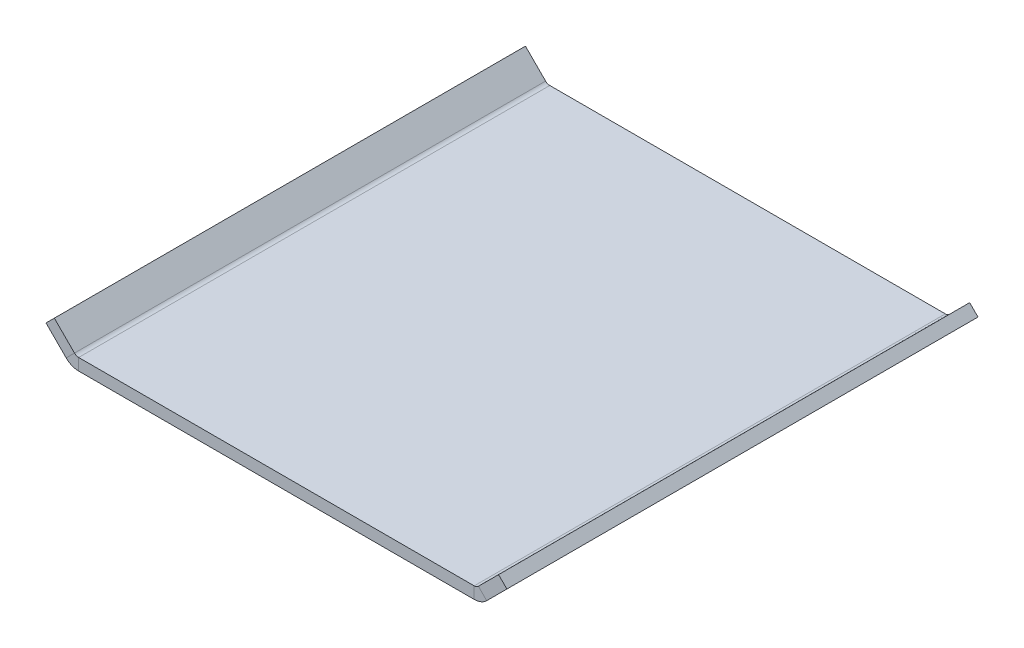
ISO-10303-21;
HEADER;
FILE_DESCRIPTION(('STEP AP214'),'2;1');
FILE_NAME('part.step','',(''),(''),'','','');
FILE_SCHEMA(('AUTOMOTIVE_DESIGN { 1 0 10303 214 1 1 1 1 }'));
ENDSEC;
DATA;
#1=APPLICATION_CONTEXT('core data for automotive mechanical design processes');
#2=APPLICATION_PROTOCOL_DEFINITION('international standard','automotive_design',2000,#1);
#3=PRODUCT_CONTEXT('',#1,'mechanical');
#4=PRODUCT('Part','Part','',(#3));
#5=PRODUCT_RELATED_PRODUCT_CATEGORY('part','',(#4));
#6=PRODUCT_DEFINITION_FORMATION('','',#4);
#7=PRODUCT_DEFINITION_CONTEXT('part definition',#1,'design');
#8=PRODUCT_DEFINITION('design','',#6,#7);
#9=PRODUCT_DEFINITION_SHAPE('','',#8);
#10=(LENGTH_UNIT() NAMED_UNIT(*) SI_UNIT(.MILLI.,.METRE.));
#11=(NAMED_UNIT(*) PLANE_ANGLE_UNIT() SI_UNIT($,.RADIAN.));
#12=(NAMED_UNIT(*) SI_UNIT($,.STERADIAN.) SOLID_ANGLE_UNIT());
#13=UNCERTAINTY_MEASURE_WITH_UNIT(LENGTH_MEASURE(1.E-05),#10,'distance_accuracy_value','');
#14=(GEOMETRIC_REPRESENTATION_CONTEXT(3) GLOBAL_UNCERTAINTY_ASSIGNED_CONTEXT((#13)) GLOBAL_UNIT_ASSIGNED_CONTEXT((#10,
#11,#12)) REPRESENTATION_CONTEXT('',''));
#15=CARTESIAN_POINT('',(0.,0.,0.));
#16=DIRECTION('',(0.,0.,1.));
#17=DIRECTION('',(1.,0.,0.));
#18=AXIS2_PLACEMENT_3D('',#15,#16,#17);
#19=CARTESIAN_POINT('',(0.,-6.35,0.));
#20=DIRECTION('',(0.,1.,0.));
#21=DIRECTION('',(0.,0.,1.));
#22=AXIS2_PLACEMENT_3D('',#19,#20,#21);
#23=PLANE('',#22);
#24=DIRECTION('',(-0.707106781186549,0.,-0.707106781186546));
#25=VECTOR('',#24,1.);
#26=CARTESIAN_POINT('',(-106.120727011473,-6.35,106.120727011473));
#27=LINE('',#26,#25);
#28=CARTESIAN_POINT('',(-94.9856629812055,-6.35,117.25579104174));
#29=VERTEX_POINT('',#28);
#30=CARTESIAN_POINT('',(-99.4757910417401,-6.35,112.765662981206));
#31=VERTEX_POINT('',#30);
#32=EDGE_CURVE('E453',#29,#31,#27,.T.);
#33=ORIENTED_EDGE('',*,*,#32,.F.);
#34=DIRECTION('',(-0.707106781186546,0.,0.707106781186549));
#35=VECTOR('',#34,1.);
#36=CARTESIAN_POINT('',(11.1350640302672,-6.35,11.1350640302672));
#37=LINE('',#36,#35);
#38=CARTESIAN_POINT('',(-48.5098079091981,-6.35,70.7799359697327));
#39=VERTEX_POINT('',#38);
#40=EDGE_CURVE('E399',#39,#29,#37,.T.);
#41=ORIENTED_EDGE('',*,*,#40,.F.);
#42=CARTESIAN_POINT('',(-46.2647438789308,-6.35,73.025));
#43=DIRECTION('',(0.,1.,0.));
#44=DIRECTION('',(0.,0.,1.));
#45=AXIS2_PLACEMENT_3D('',#42,#43,#44);
#46=CIRCLE('',#45,3.175);
#47=CARTESIAN_POINT('',(-46.2647438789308,-6.35,69.85));
#48=VERTEX_POINT('',#47);
#49=EDGE_CURVE('E411',#48,#39,#46,.T.);
#50=ORIENTED_EDGE('',*,*,#49,.F.);
#51=DIRECTION('',(-1.,0.,0.));
#52=VECTOR('',#51,1.);
#53=CARTESIAN_POINT('',(0.,-6.35,69.85));
#54=LINE('',#53,#52);
#55=CARTESIAN_POINT('',(-38.0548719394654,-6.35,69.85));
#56=VERTEX_POINT('',#55);
#57=EDGE_CURVE('E414',#56,#48,#54,.T.);
#58=ORIENTED_EDGE('',*,*,#57,.F.);
#59=DIRECTION('',(0.,0.,-1.));
#60=VECTOR('',#59,1.);
#61=CARTESIAN_POINT('',(-38.0548719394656,-6.35,0.));
#62=LINE('',#61,#60);
#63=CARTESIAN_POINT('',(-38.0548719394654,-6.35,76.2));
#64=VERTEX_POINT('',#63);
#65=EDGE_CURVE('E417',#64,#56,#62,.T.);
#66=ORIENTED_EDGE('',*,*,#65,.F.);
#67=DIRECTION('',(-1.,0.,0.));
#68=VECTOR('',#67,1.);
#69=CARTESIAN_POINT('',(0.,-6.35,76.2));
#70=LINE('',#69,#68);
#71=CARTESIAN_POINT('',(38.1451280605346,-6.35,76.2));
#72=VERTEX_POINT('',#71);
#73=EDGE_CURVE('E420',#72,#64,#70,.T.);
#74=ORIENTED_EDGE('',*,*,#73,.F.);
#75=DIRECTION('',(0.,0.,1.));
#76=VECTOR('',#75,1.);
#77=CARTESIAN_POINT('',(38.1451280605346,-6.35,0.));
#78=LINE('',#77,#76);
#79=CARTESIAN_POINT('',(38.1451280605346,-6.35,69.85));
#80=VERTEX_POINT('',#79);
#81=EDGE_CURVE('E423',#80,#72,#78,.T.);
#82=ORIENTED_EDGE('',*,*,#81,.F.);
#83=DIRECTION('',(-1.,0.,0.));
#84=VECTOR('',#83,1.);
#85=CARTESIAN_POINT('',(0.,-6.35,69.85));
#86=LINE('',#85,#84);
#87=CARTESIAN_POINT('',(46.355,-6.35,69.85));
#88=VERTEX_POINT('',#87);
#89=EDGE_CURVE('E426',#88,#80,#86,.T.);
#90=ORIENTED_EDGE('',*,*,#89,.F.);
#91=CARTESIAN_POINT('',(46.355,-6.35,73.025));
#92=DIRECTION('',(0.,1.,0.));
#93=DIRECTION('',(0.,0.,1.));
#94=AXIS2_PLACEMENT_3D('',#91,#92,#93);
#95=CIRCLE('',#94,3.175);
#96=CARTESIAN_POINT('',(48.6000640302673,-6.35,70.7799359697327));
#97=VERTEX_POINT('',#96);
#98=EDGE_CURVE('E429',#97,#88,#95,.T.);
#99=ORIENTED_EDGE('',*,*,#98,.F.);
#100=DIRECTION('',(-0.707106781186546,0.,-0.707106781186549));
#101=VECTOR('',#100,1.);
#102=CARTESIAN_POINT('',(-11.0899359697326,-6.35,11.0899359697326));
#103=LINE('',#102,#101);
#104=CARTESIAN_POINT('',(95.0759191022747,-6.35,117.25579104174));
#105=VERTEX_POINT('',#104);
#106=EDGE_CURVE('E432',#105,#97,#103,.T.);
#107=ORIENTED_EDGE('',*,*,#106,.F.);
#108=DIRECTION('',(-0.707106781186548,0.,0.707106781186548));
#109=VECTOR('',#108,1.);
#110=CARTESIAN_POINT('',(106.165855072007,-6.35,106.165855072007));
#111=LINE('',#110,#109);
#112=CARTESIAN_POINT('',(99.5660471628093,-6.35,112.765662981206));
#113=VERTEX_POINT('',#112);
#114=EDGE_CURVE('E435',#113,#105,#111,.T.);
#115=ORIENTED_EDGE('',*,*,#114,.F.);
#116=DIRECTION('',(0.707106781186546,0.,0.707106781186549));
#117=VECTOR('',#116,1.);
#118=CARTESIAN_POINT('',(-6.59980790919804,-6.35,6.59980790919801));
#119=LINE('',#118,#117);
#120=CARTESIAN_POINT('',(53.0901920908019,-6.35,66.2898079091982));
#121=VERTEX_POINT('',#120);
#122=EDGE_CURVE('E438',#121,#113,#119,.T.);
#123=ORIENTED_EDGE('',*,*,#122,.F.);
#124=CARTESIAN_POINT('',(46.355,-6.35,73.025));
#125=DIRECTION('',(0.,1.,0.));
#126=DIRECTION('',(0.,0.,1.));
#127=AXIS2_PLACEMENT_3D('',#124,#125,#126);
#128=CIRCLE('',#127,9.525);
#129=CARTESIAN_POINT('',(46.355,-6.35,63.5));
#130=VERTEX_POINT('',#129);
#131=EDGE_CURVE('E441',#130,#121,#128,.F.);
#132=ORIENTED_EDGE('',*,*,#131,.F.);
#133=DIRECTION('',(1.,0.,0.));
#134=VECTOR('',#133,1.);
#135=CARTESIAN_POINT('',(0.,-6.35,63.5));
#136=LINE('',#135,#134);
#137=CARTESIAN_POINT('',(-46.2647438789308,-6.35,63.5));
#138=VERTEX_POINT('',#137);
#139=EDGE_CURVE('E444',#138,#130,#136,.T.);
#140=ORIENTED_EDGE('',*,*,#139,.F.);
#141=CARTESIAN_POINT('',(-46.2647438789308,-6.35,73.025));
#142=DIRECTION('',(0.,1.,0.));
#143=DIRECTION('',(0.,0.,1.));
#144=AXIS2_PLACEMENT_3D('',#141,#142,#143);
#145=CIRCLE('',#144,9.525);
#146=CARTESIAN_POINT('',(-52.9999359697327,-6.35,66.2898079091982));
#147=VERTEX_POINT('',#146);
#148=EDGE_CURVE('E447',#147,#138,#145,.F.);
#149=ORIENTED_EDGE('',*,*,#148,.F.);
#150=DIRECTION('',(0.707106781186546,0.,-0.707106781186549));
#151=VECTOR('',#150,1.);
#152=CARTESIAN_POINT('',(6.64493596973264,-6.35,6.64493596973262));
#153=LINE('',#152,#151);
#154=EDGE_CURVE('E450',#31,#147,#153,.T.);
#155=ORIENTED_EDGE('',*,*,#154,.F.);
#156=EDGE_LOOP('',(#33,#41,#50,#58,#66,#74,#82,#90,#99,#107,#115,#123,#132,#140,#149,#155));
#157=FACE_BOUND('',#156,.T.);
#158=DIRECTION('',(1.,0.,0.));
#159=VECTOR('',#158,1.);
#160=CARTESIAN_POINT('',(-127.,-6.35,127.));
#161=LINE('',#160,#159);
#162=CARTESIAN_POINT('',(-106.634871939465,-6.35,127.));
#163=VERTEX_POINT('',#162);
#164=CARTESIAN_POINT('',(106.634871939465,-6.35,127.));
#165=VERTEX_POINT('',#164);
#166=EDGE_CURVE('E378',#163,#165,#161,.T.);
#167=ORIENTED_EDGE('',*,*,#166,.F.);
#168=DIRECTION('',(0.,0.,-1.));
#169=VECTOR('',#168,1.);
#170=CARTESIAN_POINT('',(-106.634871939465,-6.35,0.));
#171=LINE('',#170,#169);
#172=CARTESIAN_POINT('',(-106.634871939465,-6.35,-127.));
#173=VERTEX_POINT('',#172);
#174=EDGE_CURVE('E387',#163,#173,#171,.T.);
#175=ORIENTED_EDGE('',*,*,#174,.T.);
#176=DIRECTION('',(-1.,0.,0.));
#177=VECTOR('',#176,1.);
#178=CARTESIAN_POINT('',(-127.,-6.35,-127.));
#179=LINE('',#178,#177);
#180=CARTESIAN_POINT('',(106.634871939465,-6.35,-127.));
#181=VERTEX_POINT('',#180);
#182=EDGE_CURVE('E400',#181,#173,#179,.T.);
#183=ORIENTED_EDGE('',*,*,#182,.F.);
#184=DIRECTION('',(0.,0.,-1.));
#185=VECTOR('',#184,1.);
#186=CARTESIAN_POINT('',(106.634871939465,-6.35,0.));
#187=LINE('',#186,#185);
#188=EDGE_CURVE('E375',#165,#181,#187,.T.);
#189=ORIENTED_EDGE('',*,*,#188,.F.);
#190=EDGE_LOOP('',(#167,#175,#183,#189));
#191=FACE_BOUND('',#190,.T.);
#192=CARTESIAN_POINT('',(-46.2647438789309,-6.35,-73.025));
#193=DIRECTION('',(0.,1.,0.));
#194=DIRECTION('',(0.,0.,1.));
#195=AXIS2_PLACEMENT_3D('',#192,#193,#194);
#196=CIRCLE('',#195,9.52500000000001);
#197=CARTESIAN_POINT('',(-46.2647438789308,-6.35,-63.5));
#198=VERTEX_POINT('',#197);
#199=CARTESIAN_POINT('',(-52.9999359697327,-6.35,-66.2898079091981));
#200=VERTEX_POINT('',#199);
#201=EDGE_CURVE('E12',#198,#200,#196,.F.);
#202=ORIENTED_EDGE('',*,*,#201,.F.);
#203=DIRECTION('',(-1.,0.,0.));
#204=VECTOR('',#203,1.);
#205=CARTESIAN_POINT('',(0.,-6.35,-63.5));
#206=LINE('',#205,#204);
#207=CARTESIAN_POINT('',(46.355,-6.35,-63.5));
#208=VERTEX_POINT('',#207);
#209=EDGE_CURVE('E456',#208,#198,#206,.T.);
#210=ORIENTED_EDGE('',*,*,#209,.F.);
#211=CARTESIAN_POINT('',(46.355,-6.35,-73.025));
#212=DIRECTION('',(0.,1.,0.));
#213=DIRECTION('',(0.,0.,1.));
#214=AXIS2_PLACEMENT_3D('',#211,#212,#213);
#215=CIRCLE('',#214,9.525);
#216=CARTESIAN_POINT('',(53.0901920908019,-6.35,-66.2898079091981));
#217=VERTEX_POINT('',#216);
#218=EDGE_CURVE('E459',#217,#208,#215,.F.);
#219=ORIENTED_EDGE('',*,*,#218,.F.);
#220=DIRECTION('',(-0.707106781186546,0.,0.707106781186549));
#221=VECTOR('',#220,1.);
#222=CARTESIAN_POINT('',(-6.59980790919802,-6.35,-6.599807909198));
#223=LINE('',#222,#221);
#224=CARTESIAN_POINT('',(99.5660471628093,-6.35,-112.765662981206));
#225=VERTEX_POINT('',#224);
#226=EDGE_CURVE('E462',#225,#217,#223,.T.);
#227=ORIENTED_EDGE('',*,*,#226,.F.);
#228=DIRECTION('',(0.707106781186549,0.,0.707106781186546));
#229=VECTOR('',#228,1.);
#230=CARTESIAN_POINT('',(106.165855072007,-6.35,-106.165855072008));
#231=LINE('',#230,#229);
#232=CARTESIAN_POINT('',(95.0759191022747,-6.35,-117.25579104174));
#233=VERTEX_POINT('',#232);
#234=EDGE_CURVE('E465',#233,#225,#231,.T.);
#235=ORIENTED_EDGE('',*,*,#234,.F.);
#236=DIRECTION('',(0.707106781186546,0.,-0.707106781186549));
#237=VECTOR('',#236,1.);
#238=CARTESIAN_POINT('',(-11.0899359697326,-6.35,-11.0899359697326));
#239=LINE('',#238,#237);
#240=CARTESIAN_POINT('',(48.6000640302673,-6.35,-70.7799359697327));
#241=VERTEX_POINT('',#240);
#242=EDGE_CURVE('E468',#241,#233,#239,.T.);
#243=ORIENTED_EDGE('',*,*,#242,.F.);
#244=CARTESIAN_POINT('',(46.355,-6.35,-73.025));
#245=DIRECTION('',(0.,1.,0.));
#246=DIRECTION('',(0.,0.,1.));
#247=AXIS2_PLACEMENT_3D('',#244,#245,#246);
#248=CIRCLE('',#247,3.175);
#249=CARTESIAN_POINT('',(46.355,-6.35,-69.85));
#250=VERTEX_POINT('',#249);
#251=EDGE_CURVE('E471',#250,#241,#248,.T.);
#252=ORIENTED_EDGE('',*,*,#251,.F.);
#253=DIRECTION('',(1.,0.,0.));
#254=VECTOR('',#253,1.);
#255=CARTESIAN_POINT('',(0.,-6.35,-69.85));
#256=LINE('',#255,#254);
#257=CARTESIAN_POINT('',(38.1451280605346,-6.35,-69.85));
#258=VERTEX_POINT('',#257);
#259=EDGE_CURVE('E474',#258,#250,#256,.T.);
#260=ORIENTED_EDGE('',*,*,#259,.F.);
#261=DIRECTION('',(0.,0.,1.));
#262=VECTOR('',#261,1.);
#263=CARTESIAN_POINT('',(38.1451280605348,-6.35,0.));
#264=LINE('',#263,#262);
#265=CARTESIAN_POINT('',(38.1451280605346,-6.35,-76.2));
#266=VERTEX_POINT('',#265);
#267=EDGE_CURVE('E477',#266,#258,#264,.T.);
#268=ORIENTED_EDGE('',*,*,#267,.F.);
#269=DIRECTION('',(1.,0.,0.));
#270=VECTOR('',#269,1.);
#271=CARTESIAN_POINT('',(0.,-6.35,-76.2));
#272=LINE('',#271,#270);
#273=CARTESIAN_POINT('',(-38.0548719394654,-6.35,-76.2));
#274=VERTEX_POINT('',#273);
#275=EDGE_CURVE('E480',#274,#266,#272,.T.);
#276=ORIENTED_EDGE('',*,*,#275,.F.);
#277=DIRECTION('',(0.,0.,-1.));
#278=VECTOR('',#277,1.);
#279=CARTESIAN_POINT('',(-38.0548719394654,-6.35,0.));
#280=LINE('',#279,#278);
#281=CARTESIAN_POINT('',(-38.0548719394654,-6.35,-69.85));
#282=VERTEX_POINT('',#281);
#283=EDGE_CURVE('E483',#282,#274,#280,.T.);
#284=ORIENTED_EDGE('',*,*,#283,.F.);
#285=DIRECTION('',(1.,0.,0.));
#286=VECTOR('',#285,1.);
#287=CARTESIAN_POINT('',(0.,-6.35,-69.85));
#288=LINE('',#287,#286);
#289=CARTESIAN_POINT('',(-46.2647438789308,-6.35,-69.85));
#290=VERTEX_POINT('',#289);
#291=EDGE_CURVE('E486',#290,#282,#288,.T.);
#292=ORIENTED_EDGE('',*,*,#291,.F.);
#293=CARTESIAN_POINT('',(-46.2647438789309,-6.35,-73.025));
#294=DIRECTION('',(0.,1.,0.));
#295=DIRECTION('',(0.,0.,1.));
#296=AXIS2_PLACEMENT_3D('',#293,#294,#295);
#297=CIRCLE('',#296,3.175);
#298=CARTESIAN_POINT('',(-48.5098079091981,-6.35,-70.7799359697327));
#299=VERTEX_POINT('',#298);
#300=EDGE_CURVE('E489',#299,#290,#297,.T.);
#301=ORIENTED_EDGE('',*,*,#300,.F.);
#302=DIRECTION('',(0.707106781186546,0.,0.707106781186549));
#303=VECTOR('',#302,1.);
#304=CARTESIAN_POINT('',(11.1350640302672,-6.35,-11.1350640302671));
#305=LINE('',#304,#303);
#306=CARTESIAN_POINT('',(-94.9856629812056,-6.35,-117.25579104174));
#307=VERTEX_POINT('',#306);
#308=EDGE_CURVE('E492',#307,#299,#305,.T.);
#309=ORIENTED_EDGE('',*,*,#308,.F.);
#310=DIRECTION('',(0.707106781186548,0.,-0.707106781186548));
#311=VECTOR('',#310,1.);
#312=CARTESIAN_POINT('',(-106.120727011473,-6.35,-106.120727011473));
#313=LINE('',#312,#311);
#314=CARTESIAN_POINT('',(-99.4757910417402,-6.35,-112.765662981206));
#315=VERTEX_POINT('',#314);
#316=EDGE_CURVE('E495',#315,#307,#313,.T.);
#317=ORIENTED_EDGE('',*,*,#316,.F.);
#318=DIRECTION('',(-0.707106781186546,0.,-0.707106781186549));
#319=VECTOR('',#318,1.);
#320=CARTESIAN_POINT('',(6.64493596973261,-6.35,-6.64493596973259));
#321=LINE('',#320,#319);
#322=EDGE_CURVE('E63',#200,#315,#321,.T.);
#323=ORIENTED_EDGE('',*,*,#322,.F.);
#324=EDGE_LOOP('',(#202,#210,#219,#227,#235,#243,#252,#260,#268,#276,#284,#292,#301,#309,#317,#323));
#325=FACE_BOUND('',#324,.T.);
#326=ADVANCED_FACE('F54',(#157,#191,#325),#23,.F.);
#327=ORIENTED_EDGE('',*,*,#209,.T.);
#328=ORIENTED_EDGE('',*,*,#201,.T.);
#329=ORIENTED_EDGE('',*,*,#322,.T.);
#330=ORIENTED_EDGE('',*,*,#316,.T.);
#331=ORIENTED_EDGE('',*,*,#308,.T.);
#332=ORIENTED_EDGE('',*,*,#300,.T.);
#333=ORIENTED_EDGE('',*,*,#291,.T.);
#334=ORIENTED_EDGE('',*,*,#283,.T.);
#335=ORIENTED_EDGE('',*,*,#275,.T.);
#336=ORIENTED_EDGE('',*,*,#267,.T.);
#337=ORIENTED_EDGE('',*,*,#259,.T.);
#338=ORIENTED_EDGE('',*,*,#251,.T.);
#339=ORIENTED_EDGE('',*,*,#242,.T.);
#340=ORIENTED_EDGE('',*,*,#234,.T.);
#341=ORIENTED_EDGE('',*,*,#226,.T.);
#342=ORIENTED_EDGE('',*,*,#218,.T.);
#343=EDGE_LOOP('',(#327,#328,#329,#330,#331,#332,#333,#334,#335,#336,#337,#338,#339,#340,#341,#342));
#344=FACE_BOUND('',#343,.T.);
#345=ADVANCED_FACE('F563',(#344),#23,.F.);
#346=ORIENTED_EDGE('',*,*,#40,.T.);
#347=ORIENTED_EDGE('',*,*,#32,.T.);
#348=ORIENTED_EDGE('',*,*,#154,.T.);
#349=ORIENTED_EDGE('',*,*,#148,.T.);
#350=ORIENTED_EDGE('',*,*,#139,.T.);
#351=ORIENTED_EDGE('',*,*,#131,.T.);
#352=ORIENTED_EDGE('',*,*,#122,.T.);
#353=ORIENTED_EDGE('',*,*,#114,.T.);
#354=ORIENTED_EDGE('',*,*,#106,.T.);
#355=ORIENTED_EDGE('',*,*,#98,.T.);
#356=ORIENTED_EDGE('',*,*,#89,.T.);
#357=ORIENTED_EDGE('',*,*,#81,.T.);
#358=ORIENTED_EDGE('',*,*,#73,.T.);
#359=ORIENTED_EDGE('',*,*,#65,.T.);
#360=ORIENTED_EDGE('',*,*,#57,.T.);
#361=ORIENTED_EDGE('',*,*,#49,.T.);
#362=EDGE_LOOP('',(#346,#347,#348,#349,#350,#351,#352,#353,#354,#355,#356,#357,#358,#359,#360,#361));
#363=FACE_BOUND('',#362,.T.);
#364=ADVANCED_FACE('F580',(#363),#23,.F.);
#365=CARTESIAN_POINT('',(0.,0.,0.));
#366=DIRECTION('',(0.,1.,0.));
#367=DIRECTION('',(0.,0.,1.));
#368=AXIS2_PLACEMENT_3D('',#365,#366,#367);
#369=PLANE('',#368);
#370=DIRECTION('',(0.,0.,-1.));
#371=VECTOR('',#370,1.);
#372=CARTESIAN_POINT('',(-106.634871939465,0.,0.));
#373=LINE('',#372,#371);
#374=CARTESIAN_POINT('',(-106.634871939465,0.,127.));
#375=VERTEX_POINT('',#374);
#376=CARTESIAN_POINT('',(-106.634871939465,0.,-127.));
#377=VERTEX_POINT('',#376);
#378=EDGE_CURVE('E393',#375,#377,#373,.T.);
#379=ORIENTED_EDGE('',*,*,#378,.F.);
#380=DIRECTION('',(1.,0.,0.));
#381=VECTOR('',#380,1.);
#382=CARTESIAN_POINT('',(-127.,0.,127.));
#383=LINE('',#382,#381);
#384=CARTESIAN_POINT('',(106.634871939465,0.,127.));
#385=VERTEX_POINT('',#384);
#386=EDGE_CURVE('E402',#375,#385,#383,.T.);
#387=ORIENTED_EDGE('',*,*,#386,.T.);
#388=DIRECTION('',(0.,0.,-1.));
#389=VECTOR('',#388,1.);
#390=CARTESIAN_POINT('',(106.634871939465,0.,0.));
#391=LINE('',#390,#389);
#392=CARTESIAN_POINT('',(106.634871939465,0.,-127.));
#393=VERTEX_POINT('',#392);
#394=EDGE_CURVE('E381',#385,#393,#391,.T.);
#395=ORIENTED_EDGE('',*,*,#394,.T.);
#396=DIRECTION('',(-1.,0.,0.));
#397=VECTOR('',#396,1.);
#398=CARTESIAN_POINT('',(-127.,0.,-127.));
#399=LINE('',#398,#397);
#400=EDGE_CURVE('E371',#393,#377,#399,.T.);
#401=ORIENTED_EDGE('',*,*,#400,.T.);
#402=EDGE_LOOP('',(#379,#387,#395,#401));
#403=FACE_BOUND('',#402,.T.);
#404=ADVANCED_FACE('F588',(#403),#369,.T.);
#405=CARTESIAN_POINT('',(-127.,-6.35,-127.));
#406=DIRECTION('',(0.,0.,-1.));
#407=DIRECTION('',(-1.,0.,0.));
#408=AXIS2_PLACEMENT_3D('',#405,#406,#407);
#409=PLANE('',#408);
#410=DIRECTION('',(0.,-1.,0.));
#411=VECTOR('',#410,1.);
#412=CARTESIAN_POINT('',(-106.634871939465,-6.35,-127.));
#413=LINE('',#412,#411);
#414=EDGE_CURVE('E396',#377,#173,#413,.T.);
#415=ORIENTED_EDGE('',*,*,#414,.F.);
#416=ORIENTED_EDGE('',*,*,#400,.F.);
#417=DIRECTION('',(0.,-1.,0.));
#418=VECTOR('',#417,1.);
#419=CARTESIAN_POINT('',(106.634871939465,-6.35,-127.));
#420=LINE('',#419,#418);
#421=EDGE_CURVE('E377',#393,#181,#420,.T.);
#422=ORIENTED_EDGE('',*,*,#421,.T.);
#423=ORIENTED_EDGE('',*,*,#182,.T.);
#424=EDGE_LOOP('',(#415,#416,#422,#423));
#425=FACE_BOUND('',#424,.T.);
#426=ADVANCED_FACE('F56',(#425),#409,.T.);
#427=CARTESIAN_POINT('',(-127.,-6.35,127.));
#428=DIRECTION('',(0.,0.,1.));
#429=DIRECTION('',(1.,0.,0.));
#430=AXIS2_PLACEMENT_3D('',#427,#428,#429);
#431=PLANE('',#430);
#432=DIRECTION('',(0.,1.,0.));
#433=VECTOR('',#432,1.);
#434=CARTESIAN_POINT('',(-106.634871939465,-6.35,127.));
#435=LINE('',#434,#433);
#436=EDGE_CURVE('E390',#163,#375,#435,.T.);
#437=ORIENTED_EDGE('',*,*,#436,.F.);
#438=ORIENTED_EDGE('',*,*,#166,.T.);
#439=DIRECTION('',(0.,1.,0.));
#440=VECTOR('',#439,1.);
#441=CARTESIAN_POINT('',(106.634871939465,-6.35,127.));
#442=LINE('',#441,#440);
#443=EDGE_CURVE('E384',#165,#385,#442,.T.);
#444=ORIENTED_EDGE('',*,*,#443,.T.);
#445=ORIENTED_EDGE('',*,*,#386,.F.);
#446=EDGE_LOOP('',(#437,#438,#444,#445));
#447=FACE_BOUND('',#446,.T.);
#448=ADVANCED_FACE('F612',(#447),#431,.T.);
#449=CARTESIAN_POINT('',(106.634871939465,3.175,127.));
#450=DIRECTION('',(0.,0.,1.));
#451=DIRECTION('',(1.,0.,0.));
#452=AXIS2_PLACEMENT_3D('',#449,#450,#451);
#453=PLANE('',#452);
#454=DIRECTION('',(-0.707106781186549,0.707106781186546,0.));
#455=VECTOR('',#454,1.);
#456=CARTESIAN_POINT('',(113.370064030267,-3.56019209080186,127.));
#457=LINE('',#456,#455);
#458=CARTESIAN_POINT('',(113.370064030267,-3.56019209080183,127.));
#459=VERTEX_POINT('',#458);
#460=CARTESIAN_POINT('',(108.879935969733,0.929935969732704,127.));
#461=VERTEX_POINT('',#460);
#462=EDGE_CURVE('E328',#459,#461,#457,.T.);
#463=ORIENTED_EDGE('',*,*,#462,.T.);
#464=CARTESIAN_POINT('',(106.634871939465,3.175,127.));
#465=DIRECTION('',(0.,0.,1.));
#466=DIRECTION('',(1.,0.,0.));
#467=AXIS2_PLACEMENT_3D('',#464,#465,#466);
#468=CIRCLE('',#467,3.175);
#469=EDGE_CURVE('E336',#461,#385,#468,.F.);
#470=ORIENTED_EDGE('',*,*,#469,.T.);
#471=ORIENTED_EDGE('',*,*,#443,.F.);
#472=CARTESIAN_POINT('',(106.634871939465,3.175,127.));
#473=DIRECTION('',(0.,0.,-1.));
#474=DIRECTION('',(1.,0.,0.));
#475=AXIS2_PLACEMENT_3D('',#472,#473,#474);
#476=CIRCLE('',#475,9.525);
#477=EDGE_CURVE('E364',#459,#165,#476,.T.);
#478=ORIENTED_EDGE('',*,*,#477,.F.);
#479=EDGE_LOOP('',(#463,#470,#471,#478));
#480=FACE_BOUND('',#479,.T.);
#481=ADVANCED_FACE('F616',(#480),#453,.T.);
#482=CARTESIAN_POINT('',(106.634871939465,3.175,-127.));
#483=DIRECTION('',(0.,0.,-1.));
#484=DIRECTION('',(-1.,0.,0.));
#485=AXIS2_PLACEMENT_3D('',#482,#483,#484);
#486=PLANE('',#485);
#487=CARTESIAN_POINT('',(106.634871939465,3.175,-127.));
#488=DIRECTION('',(0.,0.,1.));
#489=DIRECTION('',(1.,0.,0.));
#490=AXIS2_PLACEMENT_3D('',#487,#488,#489);
#491=CIRCLE('',#490,3.175);
#492=CARTESIAN_POINT('',(108.879935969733,0.929935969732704,-127.));
#493=VERTEX_POINT('',#492);
#494=EDGE_CURVE('E368',#393,#493,#491,.T.);
#495=ORIENTED_EDGE('',*,*,#494,.T.);
#496=DIRECTION('',(0.707106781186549,-0.707106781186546,0.));
#497=VECTOR('',#496,1.);
#498=CARTESIAN_POINT('',(113.370064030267,-3.56019209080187,-127.));
#499=LINE('',#498,#497);
#500=CARTESIAN_POINT('',(113.370064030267,-3.56019209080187,-127.));
#501=VERTEX_POINT('',#500);
#502=EDGE_CURVE('E356',#493,#501,#499,.T.);
#503=ORIENTED_EDGE('',*,*,#502,.T.);
#504=CARTESIAN_POINT('',(106.634871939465,3.175,-127.));
#505=DIRECTION('',(0.,0.,1.));
#506=DIRECTION('',(-1.,0.,0.));
#507=AXIS2_PLACEMENT_3D('',#504,#505,#506);
#508=CIRCLE('',#507,9.52500000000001);
#509=EDGE_CURVE('E367',#181,#501,#508,.T.);
#510=ORIENTED_EDGE('',*,*,#509,.F.);
#511=ORIENTED_EDGE('',*,*,#421,.F.);
#512=EDGE_LOOP('',(#495,#503,#510,#511));
#513=FACE_BOUND('',#512,.T.);
#514=ADVANCED_FACE('F621',(#513),#486,.T.);
#515=CARTESIAN_POINT('',(106.634871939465,3.175,-254.128305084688));
#516=DIRECTION('',(0.,0.,1.));
#517=DIRECTION('',(1.,0.,0.));
#518=AXIS2_PLACEMENT_3D('',#515,#516,#517);
#519=CYLINDRICAL_SURFACE('',#518,9.525);
#520=ORIENTED_EDGE('',*,*,#188,.T.);
#521=ORIENTED_EDGE('',*,*,#509,.T.);
#522=DIRECTION('',(0.,0.,-1.));
#523=VECTOR('',#522,1.);
#524=CARTESIAN_POINT('',(113.370064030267,-3.56019209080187,0.));
#525=LINE('',#524,#523);
#526=EDGE_CURVE('E349',#459,#501,#525,.T.);
#527=ORIENTED_EDGE('',*,*,#526,.F.);
#528=ORIENTED_EDGE('',*,*,#477,.T.);
#529=EDGE_LOOP('',(#520,#521,#527,#528));
#530=FACE_BOUND('',#529,.T.);
#531=ADVANCED_FACE('F666',(#530),#519,.T.);
#532=CARTESIAN_POINT('',(106.634871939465,3.175,-254.128305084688));
#533=DIRECTION('',(0.,0.,1.));
#534=DIRECTION('',(1.,0.,0.));
#535=AXIS2_PLACEMENT_3D('',#532,#533,#534);
#536=CYLINDRICAL_SURFACE('',#535,3.175);
#537=ORIENTED_EDGE('',*,*,#394,.F.);
#538=ORIENTED_EDGE('',*,*,#469,.F.);
#539=DIRECTION('',(0.,0.,-1.));
#540=VECTOR('',#539,1.);
#541=CARTESIAN_POINT('',(108.879935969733,0.929935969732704,0.));
#542=LINE('',#541,#540);
#543=EDGE_CURVE('E359',#461,#493,#542,.T.);
#544=ORIENTED_EDGE('',*,*,#543,.T.);
#545=ORIENTED_EDGE('',*,*,#494,.F.);
#546=EDGE_LOOP('',(#537,#538,#544,#545));
#547=FACE_BOUND('',#546,.T.);
#548=ADVANCED_FACE('F648',(#547),#536,.F.);
#549=CARTESIAN_POINT('',(124.243845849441,7.31358972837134,-127.));
#550=DIRECTION('',(0.707106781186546,0.707106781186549,0.));
#551=DIRECTION('',(0.,0.,-1.));
#552=AXIS2_PLACEMENT_3D('',#549,#550,#551);
#553=PLANE('',#552);
#554=DIRECTION('',(0.,0.,-1.));
#555=VECTOR('',#554,1.);
#556=CARTESIAN_POINT('',(119.753717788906,11.8037177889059,-127.));
#557=LINE('',#556,#555);
#558=CARTESIAN_POINT('',(119.753717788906,11.8037177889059,127.));
#559=VERTEX_POINT('',#558);
#560=CARTESIAN_POINT('',(119.753717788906,11.8037177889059,-127.));
#561=VERTEX_POINT('',#560);
#562=EDGE_CURVE('E341',#559,#561,#557,.T.);
#563=ORIENTED_EDGE('',*,*,#562,.F.);
#564=DIRECTION('',(-0.707106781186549,0.707106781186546,0.));
#565=VECTOR('',#564,1.);
#566=CARTESIAN_POINT('',(124.243845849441,7.31358972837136,127.));
#567=LINE('',#566,#565);
#568=CARTESIAN_POINT('',(124.243845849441,7.31358972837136,127.));
#569=VERTEX_POINT('',#568);
#570=EDGE_CURVE('E333',#569,#559,#567,.T.);
#571=ORIENTED_EDGE('',*,*,#570,.F.);
#572=DIRECTION('',(0.,0.,-1.));
#573=VECTOR('',#572,1.);
#574=CARTESIAN_POINT('',(124.243845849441,7.31358972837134,-127.));
#575=LINE('',#574,#573);
#576=CARTESIAN_POINT('',(124.243845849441,7.31358972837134,-127.));
#577=VERTEX_POINT('',#576);
#578=EDGE_CURVE('E353',#569,#577,#575,.T.);
#579=ORIENTED_EDGE('',*,*,#578,.T.);
#580=DIRECTION('',(-0.707106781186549,0.707106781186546,0.));
#581=VECTOR('',#580,1.);
#582=CARTESIAN_POINT('',(124.243845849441,7.31358972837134,-127.));
#583=LINE('',#582,#581);
#584=EDGE_CURVE('E351',#577,#561,#583,.T.);
#585=ORIENTED_EDGE('',*,*,#584,.T.);
#586=EDGE_LOOP('',(#563,#571,#579,#585));
#587=FACE_BOUND('',#586,.T.);
#588=ADVANCED_FACE('F673',(#587),#553,.T.);
#589=CARTESIAN_POINT('',(34.4412846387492,-82.4889714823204,0.));
#590=DIRECTION('',(-0.707106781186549,0.707106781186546,0.));
#591=DIRECTION('',(0.,0.,1.));
#592=AXIS2_PLACEMENT_3D('',#589,#590,#591);
#593=PLANE('',#592);
#594=DIRECTION('',(0.707106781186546,0.707106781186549,0.));
#595=VECTOR('',#594,1.);
#596=CARTESIAN_POINT('',(-55.3612765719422,-172.291532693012,127.));
#597=LINE('',#596,#595);
#598=EDGE_CURVE('E337',#459,#569,#597,.T.);
#599=ORIENTED_EDGE('',*,*,#598,.F.);
#600=ORIENTED_EDGE('',*,*,#526,.T.);
#601=DIRECTION('',(-0.707106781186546,-0.707106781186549,0.));
#602=VECTOR('',#601,1.);
#603=CARTESIAN_POINT('',(-55.3612765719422,-172.291532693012,-127.));
#604=LINE('',#603,#602);
#605=EDGE_CURVE('E346',#577,#501,#604,.T.);
#606=ORIENTED_EDGE('',*,*,#605,.F.);
#607=ORIENTED_EDGE('',*,*,#578,.F.);
#608=EDGE_LOOP('',(#599,#600,#606,#607));
#609=FACE_BOUND('',#608,.T.);
#610=ADVANCED_FACE('F663',(#609),#593,.F.);
#611=CARTESIAN_POINT('',(-55.3612765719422,-172.291532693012,-127.));
#612=DIRECTION('',(0.,0.,-1.));
#613=DIRECTION('',(-0.707106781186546,-0.707106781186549,0.));
#614=AXIS2_PLACEMENT_3D('',#611,#612,#613);
#615=PLANE('',#614);
#616=ORIENTED_EDGE('',*,*,#502,.F.);
#617=DIRECTION('',(-0.707106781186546,-0.707106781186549,0.));
#618=VECTOR('',#617,1.);
#619=CARTESIAN_POINT('',(-59.8514046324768,-167.801404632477,-127.));
#620=LINE('',#619,#618);
#621=EDGE_CURVE('E339',#561,#493,#620,.T.);
#622=ORIENTED_EDGE('',*,*,#621,.F.);
#623=ORIENTED_EDGE('',*,*,#584,.F.);
#624=ORIENTED_EDGE('',*,*,#605,.T.);
#625=EDGE_LOOP('',(#616,#622,#623,#624));
#626=FACE_BOUND('',#625,.T.);
#627=ADVANCED_FACE('F680',(#626),#615,.T.);
#628=CARTESIAN_POINT('',(29.9511565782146,-77.9988434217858,0.));
#629=DIRECTION('',(-0.707106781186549,0.707106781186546,0.));
#630=DIRECTION('',(0.,0.,1.));
#631=AXIS2_PLACEMENT_3D('',#628,#629,#630);
#632=PLANE('',#631);
#633=ORIENTED_EDGE('',*,*,#543,.F.);
#634=DIRECTION('',(0.707106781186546,0.707106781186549,0.));
#635=VECTOR('',#634,1.);
#636=CARTESIAN_POINT('',(-59.8514046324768,-167.801404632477,127.));
#637=LINE('',#636,#635);
#638=EDGE_CURVE('E344',#461,#559,#637,.T.);
#639=ORIENTED_EDGE('',*,*,#638,.T.);
#640=ORIENTED_EDGE('',*,*,#562,.T.);
#641=ORIENTED_EDGE('',*,*,#621,.T.);
#642=EDGE_LOOP('',(#633,#639,#640,#641));
#643=FACE_BOUND('',#642,.T.);
#644=ADVANCED_FACE('F652',(#643),#632,.T.);
#645=CARTESIAN_POINT('',(-55.3612765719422,-172.291532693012,127.));
#646=DIRECTION('',(0.,0.,1.));
#647=DIRECTION('',(0.707106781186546,0.707106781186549,0.));
#648=AXIS2_PLACEMENT_3D('',#645,#646,#647);
#649=PLANE('',#648);
#650=ORIENTED_EDGE('',*,*,#462,.F.);
#651=ORIENTED_EDGE('',*,*,#598,.T.);
#652=ORIENTED_EDGE('',*,*,#570,.T.);
#653=ORIENTED_EDGE('',*,*,#638,.F.);
#654=EDGE_LOOP('',(#650,#651,#652,#653));
#655=FACE_BOUND('',#654,.T.);
#656=ADVANCED_FACE('F658',(#655),#649,.T.);
#657=CARTESIAN_POINT('',(-106.634871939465,3.175,127.));
#658=DIRECTION('',(0.,0.,1.));
#659=DIRECTION('',(1.,0.,0.));
#660=AXIS2_PLACEMENT_3D('',#657,#658,#659);
#661=PLANE('',#660);
#662=ORIENTED_EDGE('',*,*,#436,.T.);
#663=CARTESIAN_POINT('',(-106.634871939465,3.175,127.));
#664=DIRECTION('',(0.,0.,-1.));
#665=DIRECTION('',(-1.,0.,0.));
#666=AXIS2_PLACEMENT_3D('',#663,#664,#665);
#667=CIRCLE('',#666,3.175);
#668=CARTESIAN_POINT('',(-108.879935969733,0.929935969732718,127.));
#669=VERTEX_POINT('',#668);
#670=EDGE_CURVE('E309',#375,#669,#667,.T.);
#671=ORIENTED_EDGE('',*,*,#670,.T.);
#672=DIRECTION('',(0.707106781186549,0.707106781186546,0.));
#673=VECTOR('',#672,1.);
#674=CARTESIAN_POINT('',(-113.370064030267,-3.56019209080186,127.));
#675=LINE('',#674,#673);
#676=CARTESIAN_POINT('',(-113.370064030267,-3.56019209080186,127.));
#677=VERTEX_POINT('',#676);
#678=EDGE_CURVE('E633',#677,#669,#675,.T.);
#679=ORIENTED_EDGE('',*,*,#678,.F.);
#680=CARTESIAN_POINT('',(-106.634871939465,3.175,127.));
#681=DIRECTION('',(0.,0.,-1.));
#682=DIRECTION('',(1.,0.,0.));
#683=AXIS2_PLACEMENT_3D('',#680,#681,#682);
#684=CIRCLE('',#683,9.525);
#685=EDGE_CURVE('E321',#163,#677,#684,.T.);
#686=ORIENTED_EDGE('',*,*,#685,.F.);
#687=EDGE_LOOP('',(#662,#671,#679,#686));
#688=FACE_BOUND('',#687,.T.);
#689=ADVANCED_FACE('F631',(#688),#661,.T.);
#690=CARTESIAN_POINT('',(-106.634871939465,3.175,-127.));
#691=DIRECTION('',(0.,0.,-1.));
#692=DIRECTION('',(-1.,0.,0.));
#693=AXIS2_PLACEMENT_3D('',#690,#691,#692);
#694=PLANE('',#693);
#695=DIRECTION('',(-0.707106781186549,-0.707106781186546,0.));
#696=VECTOR('',#695,1.);
#697=CARTESIAN_POINT('',(-113.370064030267,-3.56019209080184,-127.));
#698=LINE('',#697,#696);
#699=CARTESIAN_POINT('',(-108.879935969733,0.929935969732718,-127.));
#700=VERTEX_POINT('',#699);
#701=CARTESIAN_POINT('',(-113.370064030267,-3.56019209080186,-127.));
#702=VERTEX_POINT('',#701);
#703=EDGE_CURVE('E297',#700,#702,#698,.T.);
#704=ORIENTED_EDGE('',*,*,#703,.F.);
#705=CARTESIAN_POINT('',(-106.634871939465,3.175,-127.));
#706=DIRECTION('',(0.,0.,-1.));
#707=DIRECTION('',(-1.,0.,0.));
#708=AXIS2_PLACEMENT_3D('',#705,#706,#707);
#709=CIRCLE('',#708,3.175);
#710=EDGE_CURVE('E325',#700,#377,#709,.F.);
#711=ORIENTED_EDGE('',*,*,#710,.T.);
#712=ORIENTED_EDGE('',*,*,#414,.T.);
#713=CARTESIAN_POINT('',(-106.634871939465,3.175,-127.));
#714=DIRECTION('',(0.,0.,1.));
#715=DIRECTION('',(-1.,0.,0.));
#716=AXIS2_PLACEMENT_3D('',#713,#714,#715);
#717=CIRCLE('',#716,9.525);
#718=EDGE_CURVE('E324',#702,#173,#717,.T.);
#719=ORIENTED_EDGE('',*,*,#718,.F.);
#720=EDGE_LOOP('',(#704,#711,#712,#719));
#721=FACE_BOUND('',#720,.T.);
#722=ADVANCED_FACE('F640',(#721),#694,.T.);
#723=CARTESIAN_POINT('',(-106.634871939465,3.175,254.128305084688));
#724=DIRECTION('',(0.,0.,-1.));
#725=DIRECTION('',(-1.,0.,0.));
#726=AXIS2_PLACEMENT_3D('',#723,#724,#725);
#727=CYLINDRICAL_SURFACE('',#726,9.525);
#728=ORIENTED_EDGE('',*,*,#718,.T.);
#729=ORIENTED_EDGE('',*,*,#174,.F.);
#730=ORIENTED_EDGE('',*,*,#685,.T.);
#731=DIRECTION('',(0.,0.,-1.));
#732=VECTOR('',#731,1.);
#733=CARTESIAN_POINT('',(-113.370064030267,-3.56019209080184,0.));
#734=LINE('',#733,#732);
#735=EDGE_CURVE('E315',#677,#702,#734,.T.);
#736=ORIENTED_EDGE('',*,*,#735,.T.);
#737=EDGE_LOOP('',(#728,#729,#730,#736));
#738=FACE_BOUND('',#737,.T.);
#739=ADVANCED_FACE('F635',(#738),#727,.T.);
#740=CARTESIAN_POINT('',(-106.634871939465,3.175,254.128305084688));
#741=DIRECTION('',(0.,0.,-1.));
#742=DIRECTION('',(-1.,0.,0.));
#743=AXIS2_PLACEMENT_3D('',#740,#741,#742);
#744=CYLINDRICAL_SURFACE('',#743,3.175);
#745=ORIENTED_EDGE('',*,*,#710,.F.);
#746=DIRECTION('',(0.,0.,-1.));
#747=VECTOR('',#746,1.);
#748=CARTESIAN_POINT('',(-108.879935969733,0.929935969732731,0.));
#749=LINE('',#748,#747);
#750=EDGE_CURVE('E907',#669,#700,#749,.T.);
#751=ORIENTED_EDGE('',*,*,#750,.F.);
#752=ORIENTED_EDGE('',*,*,#670,.F.);
#753=ORIENTED_EDGE('',*,*,#378,.T.);
#754=EDGE_LOOP('',(#745,#751,#752,#753));
#755=FACE_BOUND('',#754,.T.);
#756=ADVANCED_FACE('F693',(#755),#744,.F.);
#757=CARTESIAN_POINT('',(-124.243845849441,7.3135897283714,-127.));
#758=DIRECTION('',(-0.707106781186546,0.707106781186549,0.));
#759=DIRECTION('',(0.,0.,1.));
#760=AXIS2_PLACEMENT_3D('',#757,#758,#759);
#761=PLANE('',#760);
#762=DIRECTION('',(0.,0.,1.));
#763=VECTOR('',#762,1.);
#764=CARTESIAN_POINT('',(-119.753717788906,11.803717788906,-127.));
#765=LINE('',#764,#763);
#766=CARTESIAN_POINT('',(-119.753717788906,11.803717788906,-127.));
#767=VERTEX_POINT('',#766);
#768=CARTESIAN_POINT('',(-119.753717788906,11.8037177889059,127.));
#769=VERTEX_POINT('',#768);
#770=EDGE_CURVE('E308',#767,#769,#765,.T.);
#771=ORIENTED_EDGE('',*,*,#770,.F.);
#772=DIRECTION('',(0.707106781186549,0.707106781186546,0.));
#773=VECTOR('',#772,1.);
#774=CARTESIAN_POINT('',(-124.243845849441,7.3135897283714,-127.));
#775=LINE('',#774,#773);
#776=CARTESIAN_POINT('',(-124.243845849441,7.3135897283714,-127.));
#777=VERTEX_POINT('',#776);
#778=EDGE_CURVE('E294',#777,#767,#775,.T.);
#779=ORIENTED_EDGE('',*,*,#778,.F.);
#780=DIRECTION('',(0.,0.,1.));
#781=VECTOR('',#780,1.);
#782=CARTESIAN_POINT('',(-124.243845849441,7.3135897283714,-127.));
#783=LINE('',#782,#781);
#784=CARTESIAN_POINT('',(-124.24384584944,7.31358972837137,127.));
#785=VERTEX_POINT('',#784);
#786=EDGE_CURVE('E305',#777,#785,#783,.T.);
#787=ORIENTED_EDGE('',*,*,#786,.T.);
#788=DIRECTION('',(0.707106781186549,0.707106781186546,0.));
#789=VECTOR('',#788,1.);
#790=CARTESIAN_POINT('',(-124.24384584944,7.31358972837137,127.));
#791=LINE('',#790,#789);
#792=EDGE_CURVE('E314',#785,#769,#791,.T.);
#793=ORIENTED_EDGE('',*,*,#792,.T.);
#794=EDGE_LOOP('',(#771,#779,#787,#793));
#795=FACE_BOUND('',#794,.T.);
#796=ADVANCED_FACE('F304',(#795),#761,.T.);
#797=CARTESIAN_POINT('',(-34.4412846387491,-82.4889714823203,0.));
#798=DIRECTION('',(0.707106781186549,0.707106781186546,0.));
#799=DIRECTION('',(0.,0.,1.));
#800=AXIS2_PLACEMENT_3D('',#797,#798,#799);
#801=PLANE('',#800);
#802=ORIENTED_EDGE('',*,*,#735,.F.);
#803=DIRECTION('',(0.707106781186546,-0.707106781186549,0.));
#804=VECTOR('',#803,1.);
#805=CARTESIAN_POINT('',(-124.24384584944,7.31358972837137,127.));
#806=LINE('',#805,#804);
#807=EDGE_CURVE('E313',#785,#677,#806,.T.);
#808=ORIENTED_EDGE('',*,*,#807,.F.);
#809=ORIENTED_EDGE('',*,*,#786,.F.);
#810=DIRECTION('',(-0.707106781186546,0.707106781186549,0.));
#811=VECTOR('',#810,1.);
#812=CARTESIAN_POINT('',(-124.243845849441,7.3135897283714,-127.));
#813=LINE('',#812,#811);
#814=EDGE_CURVE('E291',#702,#777,#813,.T.);
#815=ORIENTED_EDGE('',*,*,#814,.F.);
#816=EDGE_LOOP('',(#802,#808,#809,#815));
#817=FACE_BOUND('',#816,.T.);
#818=ADVANCED_FACE('F311',(#817),#801,.F.);
#819=CARTESIAN_POINT('',(-124.24384584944,7.31358972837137,127.));
#820=DIRECTION('',(0.,0.,1.));
#821=DIRECTION('',(0.707106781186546,-0.707106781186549,0.));
#822=AXIS2_PLACEMENT_3D('',#819,#820,#821);
#823=PLANE('',#822);
#824=ORIENTED_EDGE('',*,*,#807,.T.);
#825=ORIENTED_EDGE('',*,*,#678,.T.);
#826=DIRECTION('',(0.707106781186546,-0.707106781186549,0.));
#827=VECTOR('',#826,1.);
#828=CARTESIAN_POINT('',(-119.753717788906,11.8037177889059,127.));
#829=LINE('',#828,#827);
#830=EDGE_CURVE('E903',#769,#669,#829,.T.);
#831=ORIENTED_EDGE('',*,*,#830,.F.);
#832=ORIENTED_EDGE('',*,*,#792,.F.);
#833=EDGE_LOOP('',(#824,#825,#831,#832));
#834=FACE_BOUND('',#833,.T.);
#835=ADVANCED_FACE('F704',(#834),#823,.T.);
#836=CARTESIAN_POINT('',(-29.9511565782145,-77.9988434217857,0.));
#837=DIRECTION('',(0.707106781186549,0.707106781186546,0.));
#838=DIRECTION('',(0.,0.,1.));
#839=AXIS2_PLACEMENT_3D('',#836,#837,#838);
#840=PLANE('',#839);
#841=ORIENTED_EDGE('',*,*,#830,.T.);
#842=ORIENTED_EDGE('',*,*,#750,.T.);
#843=DIRECTION('',(-0.707106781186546,0.707106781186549,0.));
#844=VECTOR('',#843,1.);
#845=CARTESIAN_POINT('',(-119.753717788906,11.803717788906,-127.));
#846=LINE('',#845,#844);
#847=EDGE_CURVE('E910',#700,#767,#846,.T.);
#848=ORIENTED_EDGE('',*,*,#847,.T.);
#849=ORIENTED_EDGE('',*,*,#770,.T.);
#850=EDGE_LOOP('',(#841,#842,#848,#849));
#851=FACE_BOUND('',#850,.T.);
#852=ADVANCED_FACE('F701',(#851),#840,.T.);
#853=CARTESIAN_POINT('',(-124.243845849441,7.3135897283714,-127.));
#854=DIRECTION('',(0.,0.,-1.));
#855=DIRECTION('',(-0.707106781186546,0.707106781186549,0.));
#856=AXIS2_PLACEMENT_3D('',#853,#854,#855);
#857=PLANE('',#856);
#858=ORIENTED_EDGE('',*,*,#847,.F.);
#859=ORIENTED_EDGE('',*,*,#703,.T.);
#860=ORIENTED_EDGE('',*,*,#814,.T.);
#861=ORIENTED_EDGE('',*,*,#778,.T.);
#862=EDGE_LOOP('',(#858,#859,#860,#861));
#863=FACE_BOUND('',#862,.T.);
#864=ADVANCED_FACE('F293',(#863),#857,.T.);
#865=CLOSED_SHELL('',(#326,#345,#364,#404,#426,#448,#481,#514,#531,#548,#588,#610,#627,#644,
#656,#689,#722,#739,#756,#796,#818,#835,#852,#864));
#866=MANIFOLD_SOLID_BREP('B2',#865);
#867=ADVANCED_BREP_SHAPE_REPRESENTATION('',(#18,#866),#14);
#868=SHAPE_DEFINITION_REPRESENTATION(#9,#867);
ENDSEC;
END-ISO-10303-21;
